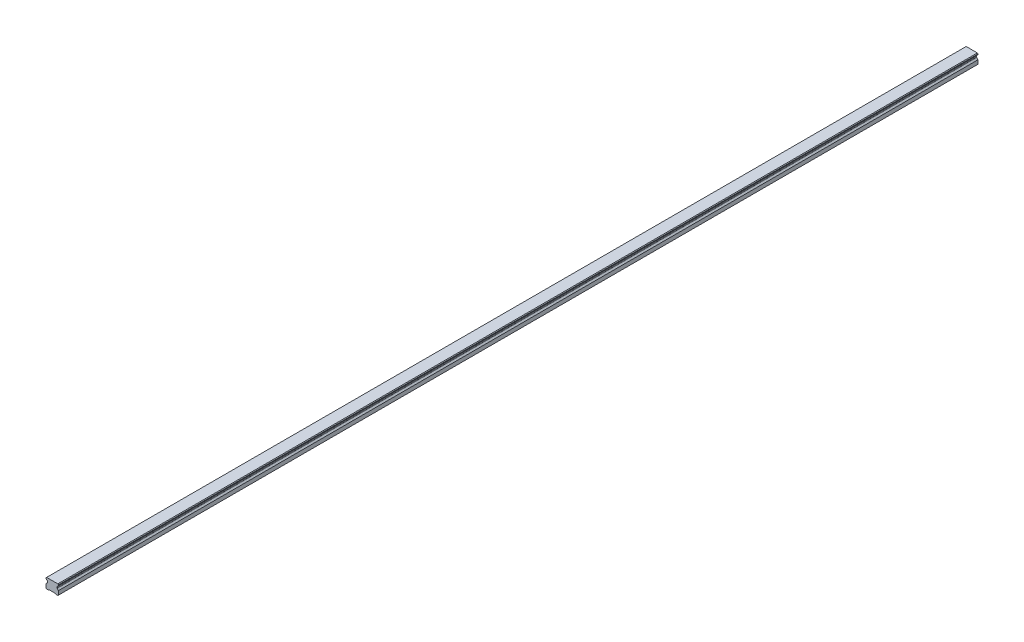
from build123d import *

# Parameters (mm, degrees)
SKETCH1_W           = 20
SKETCH1_H           = 16.3
BOSS_EXTRUDE1_DEPTH = 740
CUT_EXTRUDE1_DEPTH  = 1481.123538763
CHAMFER1_SIZE       = 1
FILLET1_R           = 1
CUT_EXTRUDE2_DEPTH  = 1481.123538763
SKETCH5_R           = 3
SKETCH5_R_2         = 2.5
CUT_EXTRUDE5_DEPTH  = 10
SKETCH5_2_R         = 2.5
CUT_EXTRUDE6_DEPTH  = 13
LPATTERN2_COUNT     = 25
LPATTERN2_PITCH     = 60


with BuildPart() as part:
    # Sketch1 → Boss-Extrude1 (new, symmetric)
    with BuildSketch(Plane.XY):
        with Locations((0, 8.15)):
            Rectangle(SKETCH1_W, SKETCH1_H)
    extrude(amount=BOSS_EXTRUDE1_DEPTH, both=True)

    # Sketch2 → Cut-Extrude1 (cut, through all)
    with BuildSketch(Plane.XY.offset(740)):
        Polygon((-10, 14.3), (-10, 7.3), (-7.666666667, 9.633333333), (-7.666666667, 11.966666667), align=None)
        Polygon((7.666666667, 11.966666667), (10, 14.3), (10, 7.3), (7.666666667, 9.633333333), align=None)
    extrude(amount=-CUT_EXTRUDE1_DEPTH, mode=Mode.SUBTRACT)

    # Chamfer1
    chamfer1_edges = [part.edges().sort_by_distance(p)[0] for p in [
        (-10, 16.3, 0),
        (10, 16.3, 0),
        (10, 0, 0),
        (-10, 0, 0),
    ]]
    chamfer(chamfer1_edges, length=CHAMFER1_SIZE)

    # Fillet1
    fillet1_edges = [part.edges().sort_by_distance(p)[0] for p in [
        (-7.666666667, 11.966666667, 0),
        (-7.666666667, 9.633333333, 0),
        (7.666666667, 9.633333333, 0),
        (7.666666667, 11.966666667, 0),
    ]]
    fillet(fillet1_edges, radius=FILLET1_R)

    # Sketch3 → Cut-Extrude2 (cut, through all)
    with BuildSketch(Plane.XY.offset(740)):
        Polygon((-6, 0), (-5, 1), (5, 1), (6, 0), align=None)
    extrude(amount=-CUT_EXTRUDE2_DEPTH, mode=Mode.SUBTRACT)

    # Sketch5 → Cut-Extrude5 (cut)
    with BuildSketch(Plane.XZ.offset(-1)):
        with Locations(Location((0, 720, 0), (0, 0, 270))):
            Circle(SKETCH5_R)
        with Locations(Location((0, 720, 0), (0, 0, 270))):
            Circle(SKETCH5_R_2, mode=Mode.SUBTRACT)
    cut_extrude5 = extrude(amount=-CUT_EXTRUDE5_DEPTH, mode=Mode.SUBTRACT)

    # Sketch5_2 → Cut-Extrude6 (cut)
    with BuildSketch(Plane.XZ.offset(-1)):
        with Locations(Location((0, 720, 0), (0, 0, 270))):
            Circle(SKETCH5_2_R)
    cut_extrude6 = extrude(amount=-CUT_EXTRUDE6_DEPTH, mode=Mode.SUBTRACT)

    # Cut-Extrude7 cone 1 section (on through the dimple's axis) → Cut-Extrude7 (revolve, cut)
    with BuildSketch(Plane(origin=(0, 14, 720), x_dir=(0, 0, -1), z_dir=(1, 0, 0))):
        Polygon((0, 0), (2.5, 0), (0, 1.443375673), align=None)
    cut_extrude7 = revolve(axis=Axis((0, 14, 720), (0, 1, 0)), mode=Mode.SUBTRACT)

    # LPattern2: Cut-Extrude5, Cut-Extrude6, Cut-Extrude7 ×25
    with Locations(*[(0, 0, -i * LPATTERN2_PITCH) for i in range(1, LPATTERN2_COUNT)]):
        add(cut_extrude5, mode=Mode.SUBTRACT)
        add(cut_extrude6, mode=Mode.SUBTRACT)
        add(cut_extrude7, mode=Mode.SUBTRACT)


solid = part.part
